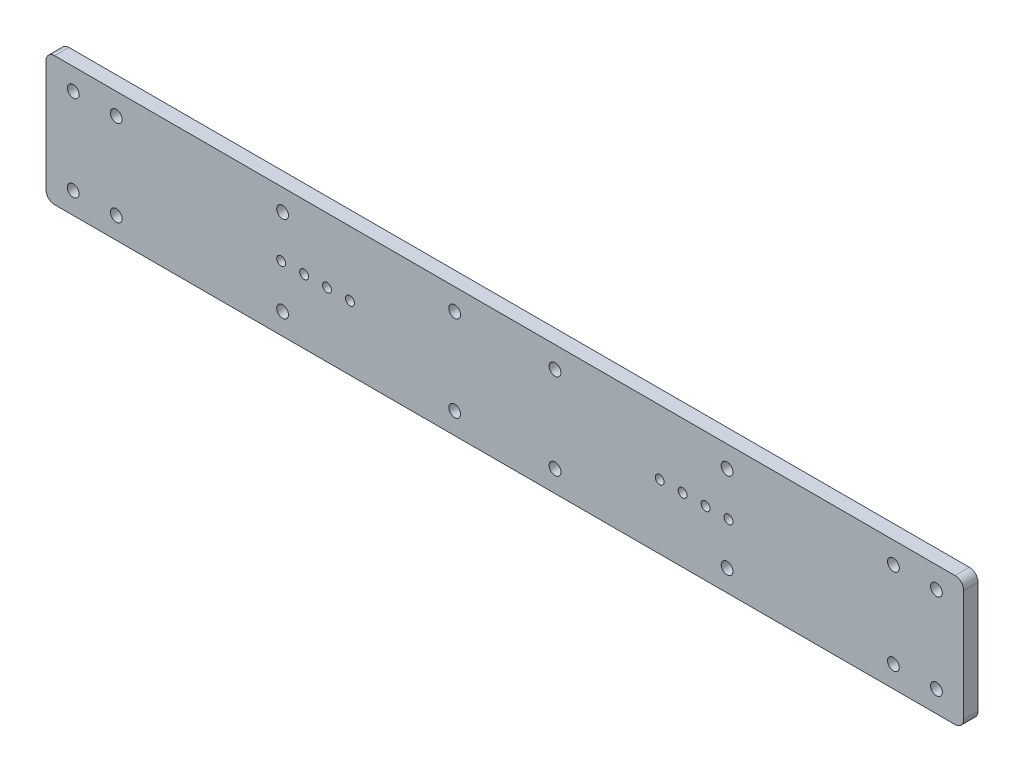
from build123d import *

# Parameters (mm, degrees)
SKETCH_1_W          = 320
SKETCH_1_H          = 45
SKETCH_1_R          = 2.05
EXTRUDE_1_DEPTH     = 5
SKETCH_2_R          = 1.55
CUT_EXTRUDE_2_DEPTH = 10
FILLET_1_R          = 3


with BuildPart() as part:
    # Sketch 1 → Extrude 1 (new body)
    with BuildSketch(Plane.XY):
        Rectangle(SKETCH_1_W, SKETCH_1_H)
        with Locations((-17.5, 15)):
            Circle(SKETCH_1_R, mode=Mode.SUBTRACT)
        with Locations((17.5, 15)):
            Circle(SKETCH_1_R, mode=Mode.SUBTRACT)
        with Locations((17.5, -15)):
            Circle(SKETCH_1_R, mode=Mode.SUBTRACT)
        with Locations((-17.5, -15)):
            Circle(SKETCH_1_R, mode=Mode.SUBTRACT)
        with Locations((-150.5, 15)):
            Circle(SKETCH_1_R, mode=Mode.SUBTRACT)
        with Locations((-135.5, 15)):
            Circle(SKETCH_1_R, mode=Mode.SUBTRACT)
        with Locations((-135.5, -15)):
            Circle(SKETCH_1_R, mode=Mode.SUBTRACT)
        with Locations((-150.5, -15)):
            Circle(SKETCH_1_R, mode=Mode.SUBTRACT)
        with Locations(Location((150.5, 15, 0), (0, 0, 180))):
            Circle(SKETCH_1_R, mode=Mode.SUBTRACT)
        with Locations(Location((150.5, -15, 0), (0, 0, 180))):
            Circle(SKETCH_1_R, mode=Mode.SUBTRACT)
        with Locations(Location((135.5, -15, 0), (0, 0, 180))):
            Circle(SKETCH_1_R, mode=Mode.SUBTRACT)
        with Locations(Location((135.5, 15, 0), (0, 0, 180))):
            Circle(SKETCH_1_R, mode=Mode.SUBTRACT)
        with Locations((-77.5, 15)):
            Circle(SKETCH_1_R, mode=Mode.SUBTRACT)
        with Locations((-77.5, -15)):
            Circle(SKETCH_1_R, mode=Mode.SUBTRACT)
        with Locations(Location((77.5, -15, 0), (0, 0, 180))):
            Circle(SKETCH_1_R, mode=Mode.SUBTRACT)
        with Locations(Location((77.5, 15, 0), (0, 0, 180))):
            Circle(SKETCH_1_R, mode=Mode.SUBTRACT)
    extrude(amount=EXTRUDE_1_DEPTH)

    # Sketch 2 → Cut-Extrude 2 (cut)
    with BuildSketch(Plane.XY.offset(5)):
        with Locations((-70, 0)):
            Circle(SKETCH_2_R)
        with Locations((-78, 0)):
            Circle(SKETCH_2_R)
        with Locations(Location((70, 0, 0), (0, 0, 180))):
            Circle(SKETCH_2_R)
        with Locations(Location((78, 0, 0), (0, 0, 180))):
            Circle(SKETCH_2_R)
        with Locations(Location((54, 0, 0), (0, 0, 180))):
            Circle(SKETCH_2_R)
        with Locations(Location((62, 0, 0), (0, 0, 180))):
            Circle(SKETCH_2_R)
        with Locations((-54, 0)):
            Circle(SKETCH_2_R)
        with Locations((-62, 0)):
            Circle(SKETCH_2_R)
    extrude(amount=-CUT_EXTRUDE_2_DEPTH, mode=Mode.SUBTRACT)

    # Fillet 1
    fillet_1_edges = [part.edges().sort_by_distance(p)[0] for p in [
        (160, -22.5, 2.5),
        (-160, -22.5, 2.5),
        (-160, 22.5, 2.5),
        (160, 22.5, 2.5),
    ]]
    fillet(fillet_1_edges, radius=FILLET_1_R)


solid = part.part
